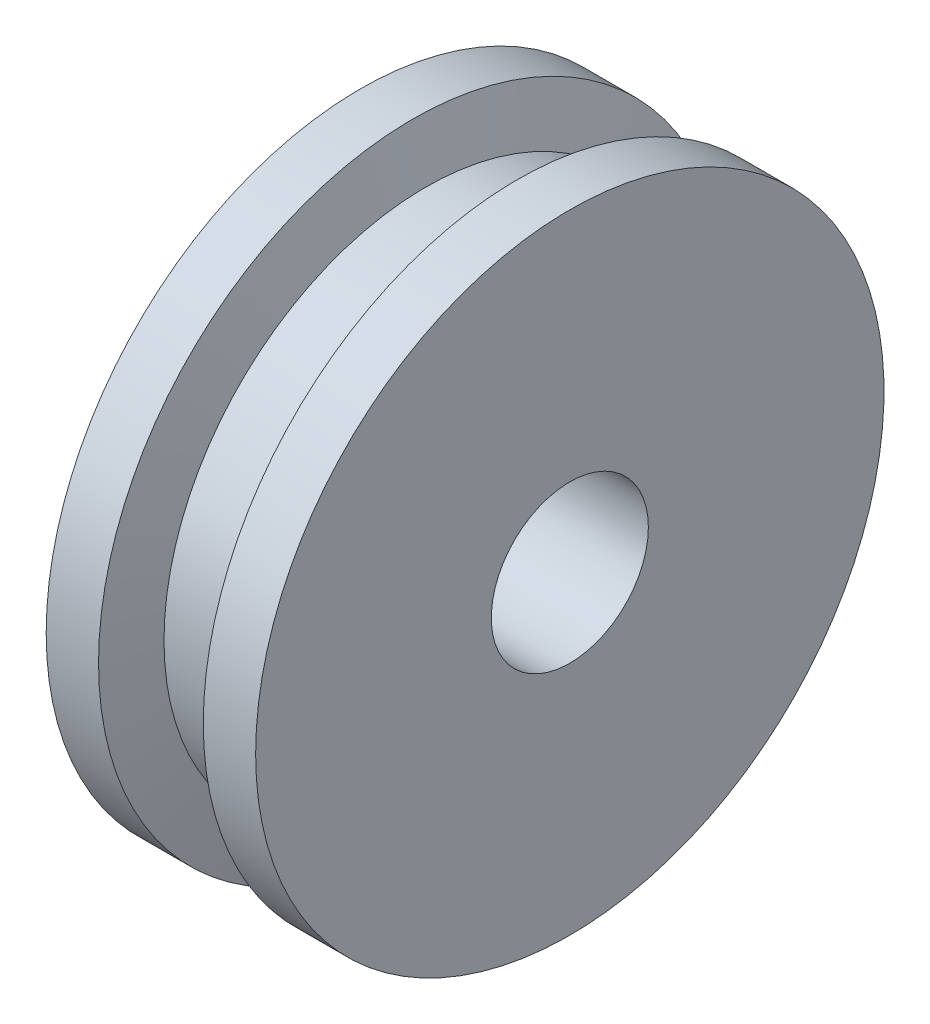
from build123d import *

# Parameters (mm, degrees)
ESQUISSE3_R             = 3
ENL_V_MAT_EXTRU_2_DEPTH = 8


with BuildPart() as part:
    # Esquisse1 → R_volution1 (revolve)
    with BuildSketch(Plane.XY, mode=Mode.PRIVATE) as r_volution1_sk:
        Polygon((-2, 12), (-1.5, 10), (1.5, 10), (2, 12), (4, 12), (4, 0), (-4, 0), (-4, 12), align=None)
    revolve(r_volution1_sk.sketch.rotate(Axis((-12.963264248, 0, 0), (1, 0, 0)), 90), axis=Axis((-12.963264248, 0, 0), (1, 0, 0)))

    # Esquisse3 → Enl_v. mat.-Extru.2 (cut)
    with BuildSketch(Plane(origin=(4, 0, 0), x_dir=(0, 0, -1), z_dir=(1, 0, 0))):
        Circle(ESQUISSE3_R)
    extrude(amount=-ENL_V_MAT_EXTRU_2_DEPTH, mode=Mode.SUBTRACT)


solid = part.part
